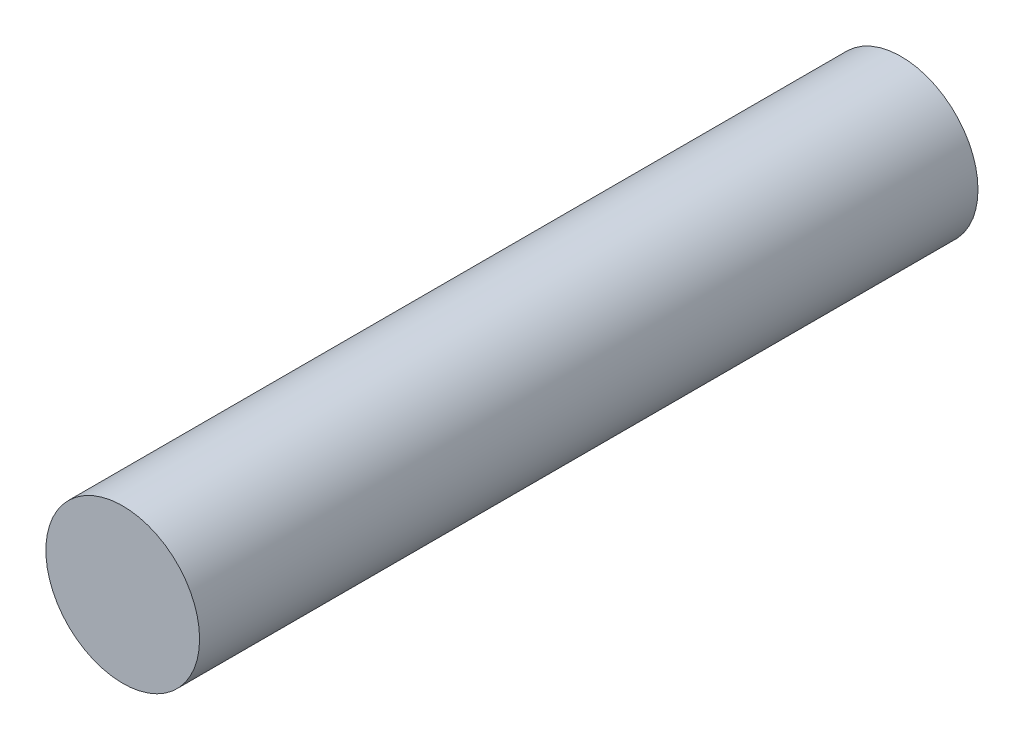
from build123d import *

# Parameters (mm, degrees)
SKIZZE1_R                       = 3.95
AUFSATZ_LINEAR_AUSTRAGEN1_DEPTH = 40


with BuildPart() as part:
    # Skizze1 → Aufsatz-Linear austragen1 (new body)
    with BuildSketch(Plane.XY):
        Circle(SKIZZE1_R)
    extrude(amount=AUFSATZ_LINEAR_AUSTRAGEN1_DEPTH)


solid = part.part
